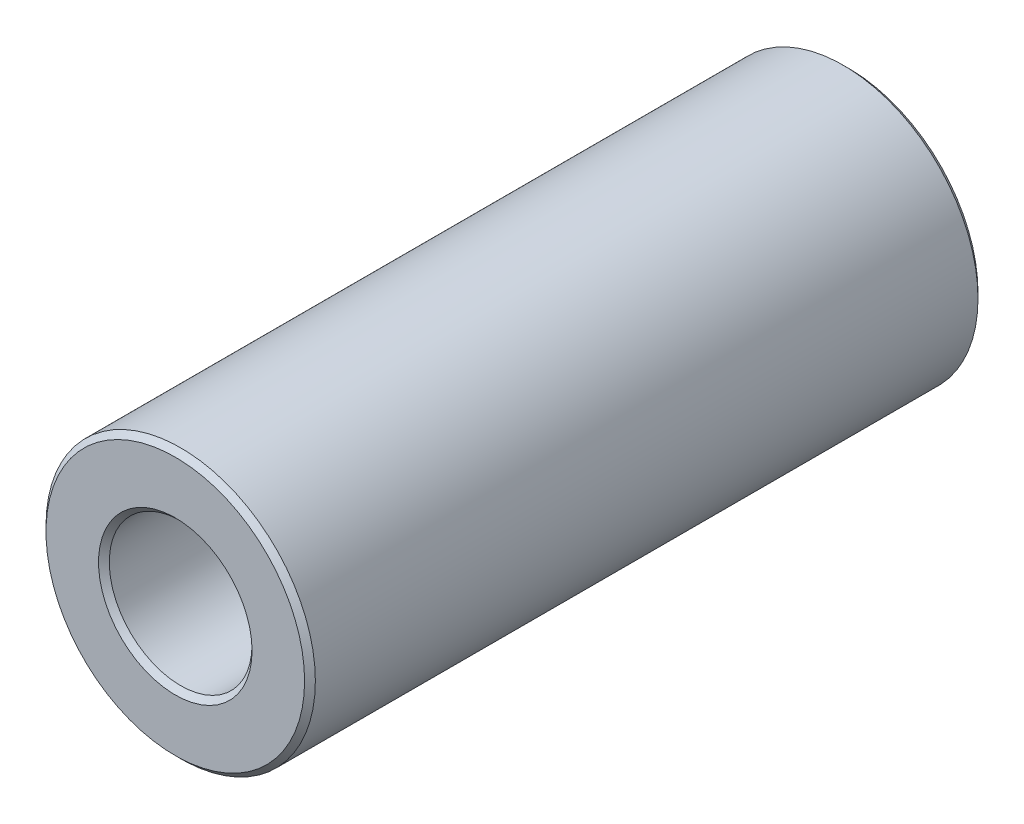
ISO-10303-21;
HEADER;
FILE_DESCRIPTION(('STEP AP214'),'2;1');
FILE_NAME('part.step','',(''),(''),'','','');
FILE_SCHEMA(('AUTOMOTIVE_DESIGN { 1 0 10303 214 1 1 1 1 }'));
ENDSEC;
DATA;
#1=APPLICATION_CONTEXT('core data for automotive mechanical design processes');
#2=APPLICATION_PROTOCOL_DEFINITION('international standard','automotive_design',2000,#1);
#3=PRODUCT_CONTEXT('',#1,'mechanical');
#4=PRODUCT('Part','Part','',(#3));
#5=PRODUCT_RELATED_PRODUCT_CATEGORY('part','',(#4));
#6=PRODUCT_DEFINITION_FORMATION('','',#4);
#7=PRODUCT_DEFINITION_CONTEXT('part definition',#1,'design');
#8=PRODUCT_DEFINITION('design','',#6,#7);
#9=PRODUCT_DEFINITION_SHAPE('','',#8);
#10=(LENGTH_UNIT() NAMED_UNIT(*) SI_UNIT(.MILLI.,.METRE.));
#11=(NAMED_UNIT(*) PLANE_ANGLE_UNIT() SI_UNIT($,.RADIAN.));
#12=(NAMED_UNIT(*) SI_UNIT($,.STERADIAN.) SOLID_ANGLE_UNIT());
#13=UNCERTAINTY_MEASURE_WITH_UNIT(LENGTH_MEASURE(1.E-05),#10,'distance_accuracy_value','');
#14=(GEOMETRIC_REPRESENTATION_CONTEXT(3) GLOBAL_UNCERTAINTY_ASSIGNED_CONTEXT((#13)) GLOBAL_UNIT_ASSIGNED_CONTEXT((#10,
#11,#12)) REPRESENTATION_CONTEXT('',''));
#15=CARTESIAN_POINT('',(0.,0.,0.));
#16=DIRECTION('',(0.,0.,1.));
#17=DIRECTION('',(1.,0.,0.));
#18=AXIS2_PLACEMENT_3D('',#15,#16,#17);
#19=CARTESIAN_POINT('',(0.,0.,12.5));
#20=DIRECTION('',(0.,0.,1.));
#21=DIRECTION('',(1.,0.,0.));
#22=AXIS2_PLACEMENT_3D('',#19,#20,#21);
#23=PLANE('',#22);
#24=CARTESIAN_POINT('',(0.,0.,12.5));
#25=DIRECTION('',(0.,0.,1.));
#26=DIRECTION('',(1.,0.,0.));
#27=AXIS2_PLACEMENT_3D('',#24,#25,#26);
#28=CIRCLE('',#27,2.85);
#29=CARTESIAN_POINT('',(2.85,0.,12.5));
#30=VERTEX_POINT('',#29);
#31=EDGE_CURVE('E10',#30,#30,#28,.F.);
#32=ORIENTED_EDGE('',*,*,#31,.T.);
#33=EDGE_LOOP('',(#32));
#34=FACE_BOUND('',#33,.T.);
#35=CARTESIAN_POINT('',(0.,0.,12.5));
#36=DIRECTION('',(0.,0.,1.));
#37=DIRECTION('',(1.,0.,0.));
#38=AXIS2_PLACEMENT_3D('',#35,#36,#37);
#39=CIRCLE('',#38,4.80000000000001);
#40=CARTESIAN_POINT('',(4.80000000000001,0.,12.5));
#41=VERTEX_POINT('',#40);
#42=EDGE_CURVE('E45',#41,#41,#39,.T.);
#43=ORIENTED_EDGE('',*,*,#42,.T.);
#44=EDGE_LOOP('',(#43));
#45=FACE_BOUND('',#44,.T.);
#46=ADVANCED_FACE('F37',(#34,#45),#23,.T.);
#47=CARTESIAN_POINT('',(0.,0.,-12.5));
#48=DIRECTION('',(0.,0.,1.));
#49=DIRECTION('',(1.,0.,0.));
#50=AXIS2_PLACEMENT_3D('',#47,#48,#49);
#51=PLANE('',#50);
#52=CARTESIAN_POINT('',(0.,0.,-12.5));
#53=DIRECTION('',(0.,0.,1.));
#54=DIRECTION('',(1.,0.,0.));
#55=AXIS2_PLACEMENT_3D('',#52,#53,#54);
#56=CIRCLE('',#55,4.8);
#57=CARTESIAN_POINT('',(4.8,0.,-12.5));
#58=VERTEX_POINT('',#57);
#59=EDGE_CURVE('E63',#58,#58,#56,.F.);
#60=ORIENTED_EDGE('',*,*,#59,.T.);
#61=EDGE_LOOP('',(#60));
#62=FACE_BOUND('',#61,.T.);
#63=CARTESIAN_POINT('',(0.,0.,-12.5));
#64=DIRECTION('',(0.,0.,1.));
#65=DIRECTION('',(1.,0.,0.));
#66=AXIS2_PLACEMENT_3D('',#63,#64,#65);
#67=CIRCLE('',#66,2.84999999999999);
#68=CARTESIAN_POINT('',(2.84999999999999,0.,-12.5));
#69=VERTEX_POINT('',#68);
#70=EDGE_CURVE('E67',#69,#69,#67,.T.);
#71=ORIENTED_EDGE('',*,*,#70,.T.);
#72=EDGE_LOOP('',(#71));
#73=FACE_BOUND('',#72,.T.);
#74=ADVANCED_FACE('F89',(#62,#73),#51,.F.);
#75=CARTESIAN_POINT('',(0.,0.,12.5));
#76=DIRECTION('',(0.,0.,-1.));
#77=DIRECTION('',(-1.,0.,0.));
#78=AXIS2_PLACEMENT_3D('',#75,#76,#77);
#79=CYLINDRICAL_SURFACE('',#78,5.);
#80=CARTESIAN_POINT('',(0.,0.,-12.3));
#81=DIRECTION('',(0.,0.,1.));
#82=DIRECTION('',(1.,0.,0.));
#83=AXIS2_PLACEMENT_3D('',#80,#81,#82);
#84=CIRCLE('',#83,5.);
#85=CARTESIAN_POINT('',(5.,0.,-12.3));
#86=VERTEX_POINT('',#85);
#87=EDGE_CURVE('E70',#86,#86,#84,.T.);
#88=ORIENTED_EDGE('',*,*,#87,.T.);
#89=EDGE_LOOP('',(#88));
#90=FACE_BOUND('',#89,.T.);
#91=CARTESIAN_POINT('',(0.,0.,12.3));
#92=DIRECTION('',(0.,0.,1.));
#93=DIRECTION('',(1.,0.,0.));
#94=AXIS2_PLACEMENT_3D('',#91,#92,#93);
#95=CIRCLE('',#94,5.);
#96=CARTESIAN_POINT('',(5.,0.,12.3));
#97=VERTEX_POINT('',#96);
#98=EDGE_CURVE('E74',#97,#97,#95,.F.);
#99=ORIENTED_EDGE('',*,*,#98,.T.);
#100=EDGE_LOOP('',(#99));
#101=FACE_BOUND('',#100,.T.);
#102=ADVANCED_FACE('F78',(#90,#101),#79,.T.);
#103=CARTESIAN_POINT('',(0.,0.,12.5));
#104=DIRECTION('',(0.,0.,-1.));
#105=DIRECTION('',(-1.,0.,0.));
#106=AXIS2_PLACEMENT_3D('',#103,#104,#105);
#107=CYLINDRICAL_SURFACE('',#106,2.65);
#108=CARTESIAN_POINT('',(0.,0.,-12.3));
#109=DIRECTION('',(0.,0.,1.));
#110=DIRECTION('',(1.,0.,0.));
#111=AXIS2_PLACEMENT_3D('',#108,#109,#110);
#112=CIRCLE('',#111,2.65);
#113=CARTESIAN_POINT('',(2.65,0.,-12.3));
#114=VERTEX_POINT('',#113);
#115=EDGE_CURVE('E52',#114,#114,#112,.F.);
#116=ORIENTED_EDGE('',*,*,#115,.T.);
#117=EDGE_LOOP('',(#116));
#118=FACE_BOUND('',#117,.T.);
#119=CARTESIAN_POINT('',(0.,0.,12.3));
#120=DIRECTION('',(0.,0.,1.));
#121=DIRECTION('',(1.,0.,0.));
#122=AXIS2_PLACEMENT_3D('',#119,#120,#121);
#123=CIRCLE('',#122,2.65);
#124=CARTESIAN_POINT('',(2.65,0.,12.3));
#125=VERTEX_POINT('',#124);
#126=EDGE_CURVE('E57',#125,#125,#123,.T.);
#127=ORIENTED_EDGE('',*,*,#126,.T.);
#128=EDGE_LOOP('',(#127));
#129=FACE_BOUND('',#128,.T.);
#130=ADVANCED_FACE('F97',(#118,#129),#107,.F.);
#131=CARTESIAN_POINT('',(0.,0.,-12.3));
#132=DIRECTION('',(0.,0.,1.));
#133=DIRECTION('',(1.,0.,0.));
#134=AXIS2_PLACEMENT_3D('',#131,#132,#133);
#135=CONICAL_SURFACE('',#134,5.,0.785398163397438);
#136=ORIENTED_EDGE('',*,*,#59,.F.);
#137=EDGE_LOOP('',(#136));
#138=FACE_BOUND('',#137,.T.);
#139=ORIENTED_EDGE('',*,*,#87,.F.);
#140=EDGE_LOOP('',(#139));
#141=FACE_BOUND('',#140,.T.);
#142=ADVANCED_FACE('F102',(#138,#141),#135,.T.);
#143=CARTESIAN_POINT('',(0.,0.,-12.5));
#144=DIRECTION('',(0.,0.,-1.));
#145=DIRECTION('',(-1.,0.,0.));
#146=AXIS2_PLACEMENT_3D('',#143,#144,#145);
#147=CONICAL_SURFACE('',#146,2.84999999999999,0.785398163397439);
#148=ORIENTED_EDGE('',*,*,#115,.F.);
#149=EDGE_LOOP('',(#148));
#150=FACE_BOUND('',#149,.T.);
#151=ORIENTED_EDGE('',*,*,#70,.F.);
#152=EDGE_LOOP('',(#151));
#153=FACE_BOUND('',#152,.T.);
#154=ADVANCED_FACE('F86',(#150,#153),#147,.F.);
#155=CARTESIAN_POINT('',(0.,0.,12.3));
#156=DIRECTION('',(0.,0.,1.));
#157=DIRECTION('',(1.,0.,0.));
#158=AXIS2_PLACEMENT_3D('',#155,#156,#157);
#159=CONICAL_SURFACE('',#158,2.65,0.785398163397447);
#160=ORIENTED_EDGE('',*,*,#31,.F.);
#161=EDGE_LOOP('',(#160));
#162=FACE_BOUND('',#161,.T.);
#163=ORIENTED_EDGE('',*,*,#126,.F.);
#164=EDGE_LOOP('',(#163));
#165=FACE_BOUND('',#164,.T.);
#166=ADVANCED_FACE('F82',(#162,#165),#159,.F.);
#167=CARTESIAN_POINT('',(0.,0.,12.5));
#168=DIRECTION('',(0.,0.,-1.));
#169=DIRECTION('',(-1.,0.,0.));
#170=AXIS2_PLACEMENT_3D('',#167,#168,#169);
#171=CONICAL_SURFACE('',#170,4.80000000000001,0.785398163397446);
#172=ORIENTED_EDGE('',*,*,#98,.F.);
#173=EDGE_LOOP('',(#172));
#174=FACE_BOUND('',#173,.T.);
#175=ORIENTED_EDGE('',*,*,#42,.F.);
#176=EDGE_LOOP('',(#175));
#177=FACE_BOUND('',#176,.T.);
#178=ADVANCED_FACE('F39',(#174,#177),#171,.T.);
#179=CLOSED_SHELL('',(#46,#74,#102,#130,#142,#154,#166,#178));
#180=MANIFOLD_SOLID_BREP('B2',#179);
#181=ADVANCED_BREP_SHAPE_REPRESENTATION('',(#18,#180),#14);
#182=SHAPE_DEFINITION_REPRESENTATION(#9,#181);
ENDSEC;
END-ISO-10303-21;
